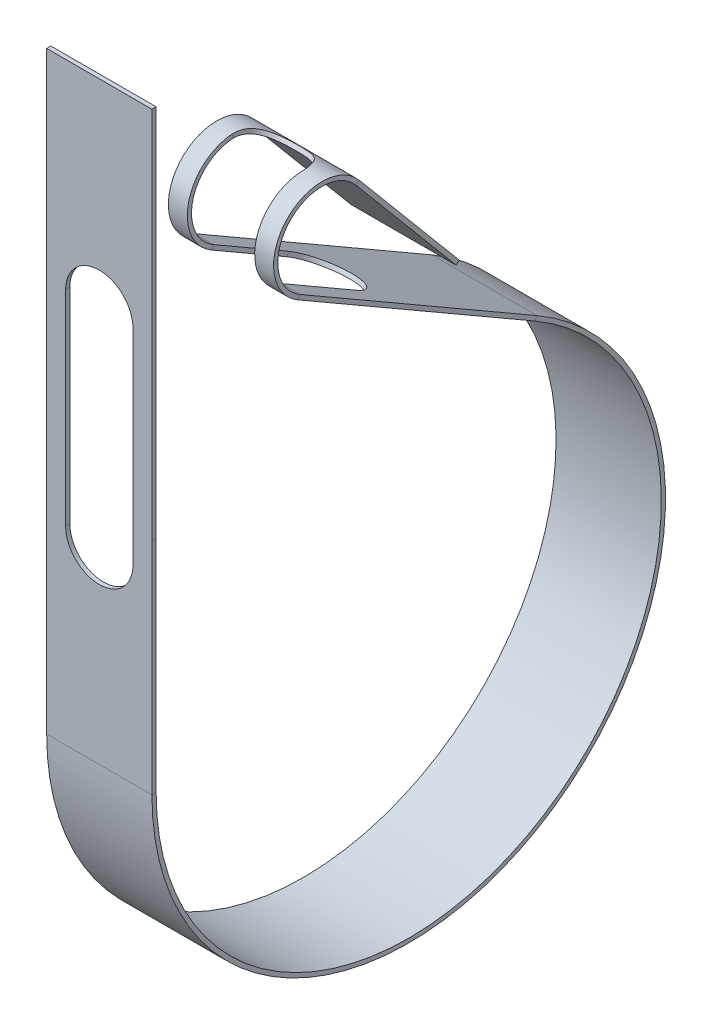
ISO-10303-21;
HEADER;
FILE_DESCRIPTION(('STEP AP214'),'2;1');
FILE_NAME('part.step','',(''),(''),'','','');
FILE_SCHEMA(('AUTOMOTIVE_DESIGN { 1 0 10303 214 1 1 1 1 }'));
ENDSEC;
DATA;
#1=APPLICATION_CONTEXT('core data for automotive mechanical design processes');
#2=APPLICATION_PROTOCOL_DEFINITION('international standard','automotive_design',2000,#1);
#3=PRODUCT_CONTEXT('',#1,'mechanical');
#4=PRODUCT('Part','Part','',(#3));
#5=PRODUCT_RELATED_PRODUCT_CATEGORY('part','',(#4));
#6=PRODUCT_DEFINITION_FORMATION('','',#4);
#7=PRODUCT_DEFINITION_CONTEXT('part definition',#1,'design');
#8=PRODUCT_DEFINITION('design','',#6,#7);
#9=PRODUCT_DEFINITION_SHAPE('','',#8);
#10=(LENGTH_UNIT() NAMED_UNIT(*) SI_UNIT(.MILLI.,.METRE.));
#11=(NAMED_UNIT(*) PLANE_ANGLE_UNIT() SI_UNIT($,.RADIAN.));
#12=(NAMED_UNIT(*) SI_UNIT($,.STERADIAN.) SOLID_ANGLE_UNIT());
#13=UNCERTAINTY_MEASURE_WITH_UNIT(LENGTH_MEASURE(1.E-05),#10,'distance_accuracy_value','');
#14=(GEOMETRIC_REPRESENTATION_CONTEXT(3) GLOBAL_UNCERTAINTY_ASSIGNED_CONTEXT((#13)) GLOBAL_UNIT_ASSIGNED_CONTEXT((#10,
#11,#12)) REPRESENTATION_CONTEXT('',''));
#15=CARTESIAN_POINT('',(0.,0.,0.));
#16=DIRECTION('',(0.,0.,1.));
#17=DIRECTION('',(1.,0.,0.));
#18=AXIS2_PLACEMENT_3D('',#15,#16,#17);
#19=CARTESIAN_POINT('',(25.,517.020311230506,31.1886671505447));
#20=DIRECTION('',(-1.,0.,0.));
#21=DIRECTION('',(0.,0.866025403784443,-0.499999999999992));
#22=AXIS2_PLACEMENT_3D('',#19,#20,#21);
#23=PLANE('',#22);
#24=DIRECTION('',(0.,-0.499999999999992,-0.866025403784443));
#25=VECTOR('',#24,1.);
#26=CARTESIAN_POINT('',(25.,516.154285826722,31.6886671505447));
#27=LINE('',#26,#25);
#28=CARTESIAN_POINT('',(25.,478.427825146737,-33.6554795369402));
#29=VERTEX_POINT('',#28);
#30=CARTESIAN_POINT('',(25.,445.89730109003,-89.9999999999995));
#31=VERTEX_POINT('',#30);
#32=EDGE_CURVE('E75',#29,#31,#27,.T.);
#33=ORIENTED_EDGE('',*,*,#32,.T.);
#34=DIRECTION('',(0.,0.866025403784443,-0.499999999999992));
#35=VECTOR('',#34,1.);
#36=CARTESIAN_POINT('',(25.,446.763326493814,-90.4999999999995));
#37=LINE('',#36,#35);
#38=CARTESIAN_POINT('',(25.,446.763326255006,-90.4999998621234));
#39=VERTEX_POINT('',#38);
#40=EDGE_CURVE('E225',#31,#39,#37,.T.);
#41=ORIENTED_EDGE('',*,*,#40,.T.);
#42=DIRECTION('',(0.,-0.499999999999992,-0.866025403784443));
#43=VECTOR('',#42,1.);
#44=CARTESIAN_POINT('',(25.,517.020311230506,31.1886671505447));
#45=LINE('',#44,#43);
#46=CARTESIAN_POINT('',(25.,479.293850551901,-34.1554795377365));
#47=VERTEX_POINT('',#46);
#48=EDGE_CURVE('E227',#47,#39,#45,.T.);
#49=ORIENTED_EDGE('',*,*,#48,.F.);
#50=DIRECTION('',(0.,-0.866025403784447,0.499999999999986));
#51=VECTOR('',#50,1.);
#52=CARTESIAN_POINT('',(25.,479.293850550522,-34.1554795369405));
#53=LINE('',#52,#51);
#54=EDGE_CURVE('E512',#47,#29,#53,.T.);
#55=ORIENTED_EDGE('',*,*,#54,.T.);
#56=EDGE_LOOP('',(#33,#41,#49,#55));
#57=FACE_BOUND('',#56,.T.);
#58=ADVANCED_FACE('F51',(#57),#23,.F.);
#59=CARTESIAN_POINT('',(25.,516.154285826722,31.6886671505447));
#60=DIRECTION('',(0.,0.866025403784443,-0.499999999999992));
#61=DIRECTION('',(1.,0.,0.));
#62=AXIS2_PLACEMENT_3D('',#59,#60,#61);
#63=PLANE('',#62);
#64=DIRECTION('',(0.,0.499999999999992,0.866025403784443));
#65=VECTOR('',#64,1.);
#66=CARTESIAN_POINT('',(0.,293.026278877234,-354.780377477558));
#67=LINE('',#66,#65);
#68=CARTESIAN_POINT('',(0.,445.89730109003,-89.9999999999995));
#69=VERTEX_POINT('',#68);
#70=CARTESIAN_POINT('',(0.,478.427825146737,-33.6554795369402));
#71=VERTEX_POINT('',#70);
#72=EDGE_CURVE('E68',#69,#71,#67,.T.);
#73=ORIENTED_EDGE('',*,*,#72,.F.);
#74=DIRECTION('',(1.,0.,0.));
#75=VECTOR('',#74,1.);
#76=CARTESIAN_POINT('',(25.,445.89730109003,-89.9999999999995));
#77=LINE('',#76,#75);
#78=EDGE_CURVE('E60',#69,#31,#77,.T.);
#79=ORIENTED_EDGE('',*,*,#78,.T.);
#80=ORIENTED_EDGE('',*,*,#32,.F.);
#81=DIRECTION('',(-1.,0.,0.));
#82=VECTOR('',#81,1.);
#83=CARTESIAN_POINT('',(25.,478.427825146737,-33.6554795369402));
#84=LINE('',#83,#82);
#85=CARTESIAN_POINT('',(20.5000000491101,478.427825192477,-33.6554795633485));
#86=VERTEX_POINT('',#85);
#87=EDGE_CURVE('E509',#29,#86,#84,.T.);
#88=ORIENTED_EDGE('',*,*,#87,.T.);
#89=DIRECTION('',(0.,-0.499999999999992,-0.866025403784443));
#90=VECTOR('',#89,1.);
#91=CARTESIAN_POINT('',(20.5000000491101,492.479381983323,-9.31746917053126));
#92=LINE('',#91,#90);
#93=CARTESIAN_POINT('',(20.5000000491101,468.137137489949,-51.4794734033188));
#94=VERTEX_POINT('',#93);
#95=EDGE_CURVE('E507',#86,#94,#92,.T.);
#96=ORIENTED_EDGE('',*,*,#95,.T.);
#97=CARTESIAN_POINT('',(12.5000000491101,468.137137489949,-51.4794734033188));
#98=DIRECTION('',(0.,0.866025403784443,-0.499999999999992));
#99=DIRECTION('',(1.,0.,0.));
#100=AXIS2_PLACEMENT_3D('',#97,#98,#99);
#101=CIRCLE('',#100,8.00000000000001);
#102=CARTESIAN_POINT('',(4.50000004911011,468.137137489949,-51.4794734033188));
#103=VERTEX_POINT('',#102);
#104=EDGE_CURVE('E504',#94,#103,#101,.T.);
#105=ORIENTED_EDGE('',*,*,#104,.T.);
#106=DIRECTION('',(0.,0.499999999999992,0.866025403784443));
#107=VECTOR('',#106,1.);
#108=CARTESIAN_POINT('',(4.50000004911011,468.137137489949,-51.4794734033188));
#109=LINE('',#108,#107);
#110=CARTESIAN_POINT('',(4.50000004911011,478.427825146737,-33.6554795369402));
#111=VERTEX_POINT('',#110);
#112=EDGE_CURVE('E502',#103,#111,#109,.T.);
#113=ORIENTED_EDGE('',*,*,#112,.T.);
#114=DIRECTION('',(-1.,0.,0.));
#115=VECTOR('',#114,1.);
#116=CARTESIAN_POINT('',(25.,478.427825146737,-33.6554795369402));
#117=LINE('',#116,#115);
#118=EDGE_CURVE('E500',#111,#71,#117,.T.);
#119=ORIENTED_EDGE('',*,*,#118,.T.);
#120=EDGE_LOOP('',(#73,#79,#80,#88,#96,#105,#113,#119));
#121=FACE_BOUND('',#120,.T.);
#122=ADVANCED_FACE('F564',(#121),#63,.F.);
#123=CARTESIAN_POINT('',(0.,293.892304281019,-355.280377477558));
#124=DIRECTION('',(1.,0.,0.));
#125=DIRECTION('',(0.,-0.866025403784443,0.499999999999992));
#126=AXIS2_PLACEMENT_3D('',#123,#124,#125);
#127=PLANE('',#126);
#128=DIRECTION('',(0.,0.499999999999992,0.866025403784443));
#129=VECTOR('',#128,1.);
#130=CARTESIAN_POINT('',(0.,293.892304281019,-355.280377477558));
#131=LINE('',#130,#129);
#132=CARTESIAN_POINT('',(0.,446.763326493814,-90.4999999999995));
#133=VERTEX_POINT('',#132);
#134=CARTESIAN_POINT('',(0.,479.293850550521,-34.1554795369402));
#135=VERTEX_POINT('',#134);
#136=EDGE_CURVE('E55',#133,#135,#131,.T.);
#137=ORIENTED_EDGE('',*,*,#136,.F.);
#138=DIRECTION('',(0.,-0.866025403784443,0.499999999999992));
#139=VECTOR('',#138,1.);
#140=CARTESIAN_POINT('',(0.,446.763326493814,-90.4999999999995));
#141=LINE('',#140,#139);
#142=EDGE_CURVE('E12',#133,#69,#141,.T.);
#143=ORIENTED_EDGE('',*,*,#142,.T.);
#144=ORIENTED_EDGE('',*,*,#72,.T.);
#145=DIRECTION('',(0.,0.866025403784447,-0.499999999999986));
#146=VECTOR('',#145,1.);
#147=CARTESIAN_POINT('',(0.,479.293850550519,-34.1554795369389));
#148=LINE('',#147,#146);
#149=EDGE_CURVE('E484',#71,#135,#148,.T.);
#150=ORIENTED_EDGE('',*,*,#149,.T.);
#151=EDGE_LOOP('',(#137,#143,#144,#150));
#152=FACE_BOUND('',#151,.T.);
#153=ADVANCED_FACE('F53',(#152),#127,.F.);
#154=CARTESIAN_POINT('',(25.,466.750091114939,-71.2678767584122));
#155=DIRECTION('',(0.,-0.642787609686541,0.766044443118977));
#156=DIRECTION('',(1.,0.,0.));
#157=AXIS2_PLACEMENT_3D('',#154,#155,#156);
#158=PLANE('',#157);
#159=DIRECTION('',(0.,0.766044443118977,0.642787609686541));
#160=VECTOR('',#159,1.);
#161=CARTESIAN_POINT('',(25.,466.750091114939,-71.2678767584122));
#162=LINE('',#161,#160);
#163=CARTESIAN_POINT('',(25.,466.750091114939,-71.2678767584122));
#164=VERTEX_POINT('',#163);
#165=CARTESIAN_POINT('',(25.,495.136387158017,-47.4489461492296));
#166=VERTEX_POINT('',#165);
#167=EDGE_CURVE('E530',#164,#166,#162,.T.);
#168=ORIENTED_EDGE('',*,*,#167,.T.);
#169=DIRECTION('',(-1.,0.,0.));
#170=VECTOR('',#169,1.);
#171=CARTESIAN_POINT('',(25.,495.136387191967,-47.4489461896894));
#172=LINE('',#171,#170);
#173=CARTESIAN_POINT('',(0.,495.136387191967,-47.4489461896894));
#174=VERTEX_POINT('',#173);
#175=EDGE_CURVE('E542',#166,#174,#172,.T.);
#176=ORIENTED_EDGE('',*,*,#175,.T.);
#177=DIRECTION('',(0.,-0.766044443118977,-0.642787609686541));
#178=VECTOR('',#177,1.);
#179=CARTESIAN_POINT('',(0.,808.60203077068,215.579959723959));
#180=LINE('',#179,#178);
#181=CARTESIAN_POINT('',(0.,466.750091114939,-71.2678767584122));
#182=VERTEX_POINT('',#181);
#183=EDGE_CURVE('E539',#174,#182,#180,.T.);
#184=ORIENTED_EDGE('',*,*,#183,.T.);
#185=DIRECTION('',(1.,0.,0.));
#186=VECTOR('',#185,1.);
#187=CARTESIAN_POINT('',(0.,466.750091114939,-71.2678767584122));
#188=LINE('',#187,#186);
#189=EDGE_CURVE('E527',#182,#164,#188,.T.);
#190=ORIENTED_EDGE('',*,*,#189,.T.);
#191=EDGE_LOOP('',(#168,#176,#184,#190));
#192=FACE_BOUND('',#191,.T.);
#193=ADVANCED_FACE('F583',(#192),#158,.T.);
#194=CARTESIAN_POINT('',(25.,467.392878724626,-72.0339212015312));
#195=DIRECTION('',(0.,-0.642787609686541,0.766044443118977));
#196=DIRECTION('',(1.,0.,0.));
#197=AXIS2_PLACEMENT_3D('',#194,#195,#196);
#198=PLANE('',#197);
#199=DIRECTION('',(-1.,0.,0.));
#200=VECTOR('',#199,1.);
#201=CARTESIAN_POINT('',(25.,495.779174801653,-48.2149906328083));
#202=LINE('',#201,#200);
#203=CARTESIAN_POINT('',(25.,495.779174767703,-48.2149905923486));
#204=VERTEX_POINT('',#203);
#205=CARTESIAN_POINT('',(0.,495.779174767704,-48.2149905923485));
#206=VERTEX_POINT('',#205);
#207=EDGE_CURVE('E547',#204,#206,#202,.T.);
#208=ORIENTED_EDGE('',*,*,#207,.F.);
#209=DIRECTION('',(0.,0.766044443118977,0.642787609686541));
#210=VECTOR('',#209,1.);
#211=CARTESIAN_POINT('',(25.,467.392878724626,-72.0339212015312));
#212=LINE('',#211,#210);
#213=CARTESIAN_POINT('',(25.,467.392878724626,-72.0339212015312));
#214=VERTEX_POINT('',#213);
#215=EDGE_CURVE('E534',#214,#204,#212,.T.);
#216=ORIENTED_EDGE('',*,*,#215,.F.);
#217=DIRECTION('',(1.,0.,0.));
#218=VECTOR('',#217,1.);
#219=CARTESIAN_POINT('',(0.,467.392878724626,-72.0339212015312));
#220=LINE('',#219,#218);
#221=CARTESIAN_POINT('',(0.,467.392878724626,-72.0339212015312));
#222=VERTEX_POINT('',#221);
#223=EDGE_CURVE('E492',#222,#214,#220,.T.);
#224=ORIENTED_EDGE('',*,*,#223,.F.);
#225=DIRECTION('',(0.,-0.766044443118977,-0.642787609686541));
#226=VECTOR('',#225,1.);
#227=CARTESIAN_POINT('',(0.,809.244818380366,214.81391528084));
#228=LINE('',#227,#226);
#229=EDGE_CURVE('E531',#206,#222,#228,.T.);
#230=ORIENTED_EDGE('',*,*,#229,.F.);
#231=EDGE_LOOP('',(#208,#216,#224,#230));
#232=FACE_BOUND('',#231,.T.);
#233=ADVANCED_FACE('F575',(#232),#198,.F.);
#234=CARTESIAN_POINT('',(0.,466.750091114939,-71.2678767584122));
#235=DIRECTION('',(0.,0.766044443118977,0.642787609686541));
#236=DIRECTION('',(-1.,0.,0.));
#237=AXIS2_PLACEMENT_3D('',#234,#235,#236);
#238=PLANE('',#237);
#239=ORIENTED_EDGE('',*,*,#223,.T.);
#240=DIRECTION('',(0.,0.642787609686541,-0.766044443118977));
#241=VECTOR('',#240,1.);
#242=CARTESIAN_POINT('',(25.,466.750091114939,-71.2678767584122));
#243=LINE('',#242,#241);
#244=EDGE_CURVE('E538',#164,#214,#243,.T.);
#245=ORIENTED_EDGE('',*,*,#244,.F.);
#246=ORIENTED_EDGE('',*,*,#189,.F.);
#247=DIRECTION('',(0.,0.642787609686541,-0.766044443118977));
#248=VECTOR('',#247,1.);
#249=CARTESIAN_POINT('',(0.,466.750091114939,-71.2678767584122));
#250=LINE('',#249,#248);
#251=EDGE_CURVE('E535',#182,#222,#250,.T.);
#252=ORIENTED_EDGE('',*,*,#251,.T.);
#253=EDGE_LOOP('',(#239,#245,#246,#252));
#254=FACE_BOUND('',#253,.T.);
#255=ADVANCED_FACE('F649',(#254),#238,.F.);
#256=CARTESIAN_POINT('',(25.,466.750091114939,-71.2678767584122));
#257=DIRECTION('',(-1.,0.,0.));
#258=DIRECTION('',(0.,-0.642787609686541,0.766044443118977));
#259=AXIS2_PLACEMENT_3D('',#256,#257,#258);
#260=PLANE('',#259);
#261=DIRECTION('',(0.,0.642787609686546,-0.766044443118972));
#262=VECTOR('',#261,1.);
#263=CARTESIAN_POINT('',(25.,495.136387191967,-47.4489461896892));
#264=LINE('',#263,#262);
#265=EDGE_CURVE('E545',#166,#204,#264,.T.);
#266=ORIENTED_EDGE('',*,*,#265,.F.);
#267=ORIENTED_EDGE('',*,*,#167,.F.);
#268=ORIENTED_EDGE('',*,*,#244,.T.);
#269=ORIENTED_EDGE('',*,*,#215,.T.);
#270=EDGE_LOOP('',(#266,#267,#268,#269));
#271=FACE_BOUND('',#270,.T.);
#272=ADVANCED_FACE('F646',(#271),#260,.F.);
#273=CARTESIAN_POINT('',(0.,808.60203077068,215.579959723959));
#274=DIRECTION('',(1.,0.,0.));
#275=DIRECTION('',(0.,0.642787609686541,-0.766044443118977));
#276=AXIS2_PLACEMENT_3D('',#273,#274,#275);
#277=PLANE('',#276);
#278=DIRECTION('',(0.,-0.642787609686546,0.766044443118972));
#279=VECTOR('',#278,1.);
#280=CARTESIAN_POINT('',(0.,495.136387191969,-47.4489461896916));
#281=LINE('',#280,#279);
#282=EDGE_CURVE('E250',#206,#174,#281,.T.);
#283=ORIENTED_EDGE('',*,*,#282,.F.);
#284=ORIENTED_EDGE('',*,*,#229,.T.);
#285=ORIENTED_EDGE('',*,*,#251,.F.);
#286=ORIENTED_EDGE('',*,*,#183,.F.);
#287=EDGE_LOOP('',(#283,#284,#285,#286));
#288=FACE_BOUND('',#287,.T.);
#289=ADVANCED_FACE('F581',(#288),#277,.F.);
#290=CARTESIAN_POINT('',(12.5000000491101,469.003162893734,-51.9794734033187));
#291=DIRECTION('',(0.,-0.866025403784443,0.499999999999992));
#292=DIRECTION('',(-1.,0.,0.));
#293=AXIS2_PLACEMENT_3D('',#290,#291,#292);
#294=CYLINDRICAL_SURFACE('',#293,8.00000000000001);
#295=ORIENTED_EDGE('',*,*,#104,.F.);
#296=DIRECTION('',(0.,-0.866025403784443,0.499999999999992));
#297=VECTOR('',#296,1.);
#298=CARTESIAN_POINT('',(20.5000000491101,469.003162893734,-51.9794734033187));
#299=LINE('',#298,#297);
#300=CARTESIAN_POINT('',(20.5000000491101,469.003162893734,-51.9794734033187));
#301=VERTEX_POINT('',#300);
#302=EDGE_CURVE('E495',#301,#94,#299,.T.);
#303=ORIENTED_EDGE('',*,*,#302,.F.);
#304=CARTESIAN_POINT('',(12.5000000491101,469.003162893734,-51.9794734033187));
#305=DIRECTION('',(0.,0.866025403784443,-0.499999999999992));
#306=DIRECTION('',(1.,0.,0.));
#307=AXIS2_PLACEMENT_3D('',#304,#305,#306);
#308=CIRCLE('',#307,8.00000000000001);
#309=CARTESIAN_POINT('',(4.50000004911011,469.003162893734,-51.9794734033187));
#310=VERTEX_POINT('',#309);
#311=EDGE_CURVE('E515',#301,#310,#308,.T.);
#312=ORIENTED_EDGE('',*,*,#311,.T.);
#313=DIRECTION('',(0.,-0.866025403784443,0.499999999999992));
#314=VECTOR('',#313,1.);
#315=CARTESIAN_POINT('',(4.50000004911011,469.003162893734,-51.9794734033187));
#316=LINE('',#315,#314);
#317=EDGE_CURVE('E241',#310,#103,#316,.T.);
#318=ORIENTED_EDGE('',*,*,#317,.T.);
#319=EDGE_LOOP('',(#295,#303,#312,#318));
#320=FACE_BOUND('',#319,.T.);
#321=ADVANCED_FACE('F645',(#320),#294,.F.);
#322=CARTESIAN_POINT('',(25.,517.020311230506,31.1886671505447));
#323=DIRECTION('',(0.,0.866025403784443,-0.499999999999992));
#324=DIRECTION('',(1.,0.,0.));
#325=AXIS2_PLACEMENT_3D('',#322,#323,#324);
#326=PLANE('',#325);
#327=DIRECTION('',(1.,0.,0.));
#328=VECTOR('',#327,1.);
#329=CARTESIAN_POINT('',(25.,446.763326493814,-90.4999999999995));
#330=LINE('',#329,#328);
#331=EDGE_CURVE('E232',#133,#39,#330,.T.);
#332=ORIENTED_EDGE('',*,*,#331,.F.);
#333=ORIENTED_EDGE('',*,*,#136,.T.);
#334=DIRECTION('',(-1.,0.,0.));
#335=VECTOR('',#334,1.);
#336=CARTESIAN_POINT('',(25.,479.293850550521,-34.1554795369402));
#337=LINE('',#336,#335);
#338=CARTESIAN_POINT('',(4.50000004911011,479.293850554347,-34.1554795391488));
#339=VERTEX_POINT('',#338);
#340=EDGE_CURVE('E524',#339,#135,#337,.T.);
#341=ORIENTED_EDGE('',*,*,#340,.F.);
#342=DIRECTION('',(0.,0.499999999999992,0.866025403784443));
#343=VECTOR('',#342,1.);
#344=CARTESIAN_POINT('',(4.50000004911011,469.003162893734,-51.9794734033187));
#345=LINE('',#344,#343);
#346=EDGE_CURVE('E493',#310,#339,#345,.T.);
#347=ORIENTED_EDGE('',*,*,#346,.F.);
#348=ORIENTED_EDGE('',*,*,#311,.F.);
#349=DIRECTION('',(0.,-0.499999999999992,-0.866025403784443));
#350=VECTOR('',#349,1.);
#351=CARTESIAN_POINT('',(20.5000000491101,493.345407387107,-9.81746917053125));
#352=LINE('',#351,#350);
#353=CARTESIAN_POINT('',(20.5000000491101,479.293850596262,-34.1554795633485));
#354=VERTEX_POINT('',#353);
#355=EDGE_CURVE('E498',#354,#301,#352,.T.);
#356=ORIENTED_EDGE('',*,*,#355,.F.);
#357=DIRECTION('',(-1.,0.,0.));
#358=VECTOR('',#357,1.);
#359=CARTESIAN_POINT('',(25.,479.293850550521,-34.1554795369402));
#360=LINE('',#359,#358);
#361=EDGE_CURVE('E240',#47,#354,#360,.T.);
#362=ORIENTED_EDGE('',*,*,#361,.F.);
#363=ORIENTED_EDGE('',*,*,#48,.T.);
#364=EDGE_LOOP('',(#332,#333,#341,#347,#348,#356,#362,#363));
#365=FACE_BOUND('',#364,.T.);
#366=ADVANCED_FACE('F237',(#365),#326,.T.);
#367=CARTESIAN_POINT('',(20.5000000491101,493.345407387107,-9.81746917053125));
#368=DIRECTION('',(-1.,0.,0.));
#369=DIRECTION('',(0.,0.866025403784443,-0.499999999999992));
#370=AXIS2_PLACEMENT_3D('',#367,#368,#369);
#371=PLANE('',#370);
#372=DIRECTION('',(0.,-0.866025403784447,0.499999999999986));
#373=VECTOR('',#372,1.);
#374=CARTESIAN_POINT('',(20.5000000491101,479.293850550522,-34.1554795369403));
#375=LINE('',#374,#373);
#376=EDGE_CURVE('E518',#354,#86,#375,.T.);
#377=ORIENTED_EDGE('',*,*,#376,.F.);
#378=ORIENTED_EDGE('',*,*,#355,.T.);
#379=ORIENTED_EDGE('',*,*,#302,.T.);
#380=ORIENTED_EDGE('',*,*,#95,.F.);
#381=EDGE_LOOP('',(#377,#378,#379,#380));
#382=FACE_BOUND('',#381,.T.);
#383=ADVANCED_FACE('F644',(#382),#371,.T.);
#384=CARTESIAN_POINT('',(4.50000004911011,469.003162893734,-51.9794734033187));
#385=DIRECTION('',(1.,0.,0.));
#386=DIRECTION('',(0.,-0.866025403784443,0.499999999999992));
#387=AXIS2_PLACEMENT_3D('',#384,#385,#386);
#388=PLANE('',#387);
#389=DIRECTION('',(0.,0.866025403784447,-0.499999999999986));
#390=VECTOR('',#389,1.);
#391=CARTESIAN_POINT('',(4.50000004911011,479.293850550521,-34.1554795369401));
#392=LINE('',#391,#390);
#393=EDGE_CURVE('E521',#111,#339,#392,.T.);
#394=ORIENTED_EDGE('',*,*,#393,.F.);
#395=ORIENTED_EDGE('',*,*,#112,.F.);
#396=ORIENTED_EDGE('',*,*,#317,.F.);
#397=ORIENTED_EDGE('',*,*,#346,.T.);
#398=EDGE_LOOP('',(#394,#395,#396,#397));
#399=FACE_BOUND('',#398,.T.);
#400=ADVANCED_FACE('F660',(#399),#388,.T.);
#401=CARTESIAN_POINT('',(25.,488.387117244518,-39.4054795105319));
#402=DIRECTION('',(-1.,0.,0.));
#403=DIRECTION('',(0.,0.866025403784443,-0.499999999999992));
#404=AXIS2_PLACEMENT_3D('',#401,#402,#403);
#405=PLANE('',#404);
#406=ORIENTED_EDGE('',*,*,#265,.T.);
#407=CARTESIAN_POINT('',(25.,488.387117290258,-39.4054795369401));
#408=DIRECTION('',(1.,0.,0.));
#409=DIRECTION('',(0.,-0.866025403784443,0.499999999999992));
#410=AXIS2_PLACEMENT_3D('',#407,#408,#409);
#411=CIRCLE('',#410,11.4999999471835);
#412=EDGE_CURVE('E270',#204,#29,#411,.T.);
#413=ORIENTED_EDGE('',*,*,#412,.T.);
#414=ORIENTED_EDGE('',*,*,#54,.F.);
#415=CARTESIAN_POINT('',(25.,488.387117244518,-39.4054795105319));
#416=DIRECTION('',(1.,0.,0.));
#417=DIRECTION('',(0.,-0.866025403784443,0.499999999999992));
#418=AXIS2_PLACEMENT_3D('',#415,#416,#417);
#419=CIRCLE('',#418,10.4999999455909);
#420=EDGE_CURVE('E347',#166,#47,#419,.T.);
#421=ORIENTED_EDGE('',*,*,#420,.F.);
#422=EDGE_LOOP('',(#406,#413,#414,#421));
#423=FACE_BOUND('',#422,.T.);
#424=ADVANCED_FACE('F587',(#423),#405,.F.);
#425=CARTESIAN_POINT('',(20.5000000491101,488.387117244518,-39.4054795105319));
#426=DIRECTION('',(1.,0.,0.));
#427=DIRECTION('',(0.,-0.866025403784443,0.499999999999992));
#428=AXIS2_PLACEMENT_3D('',#425,#426,#427);
#429=PLANE('',#428);
#430=ORIENTED_EDGE('',*,*,#376,.T.);
#431=CARTESIAN_POINT('',(20.5000000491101,488.387117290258,-39.4054795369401));
#432=DIRECTION('',(1.,0.,0.));
#433=DIRECTION('',(0.,-0.866025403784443,0.499999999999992));
#434=AXIS2_PLACEMENT_3D('',#431,#432,#433);
#435=CIRCLE('',#434,11.4999999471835);
#436=CARTESIAN_POINT('',(20.5000000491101,499.864183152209,-38.6795608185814));
#437=VERTEX_POINT('',#436);
#438=EDGE_CURVE('E357',#86,#437,#435,.F.);
#439=ORIENTED_EDGE('',*,*,#438,.T.);
#440=CARTESIAN_POINT('',(20.5000000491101,498.866177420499,-38.7426841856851));
#441=CARTESIAN_POINT('',(20.5000000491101,499.864183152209,-38.6795608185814));
#442=B_SPLINE_CURVE_WITH_KNOTS('',1,(#440,#441),.UNSPECIFIED.,.F.,.F.,(2,2),(0.,1.),.UNSPECIFIED.);
#443=CARTESIAN_POINT('',(20.5000000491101,498.866177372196,-38.7426841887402));
#444=VERTEX_POINT('',#443);
#445=EDGE_CURVE('E471',#437,#444,#442,.F.);
#446=ORIENTED_EDGE('',*,*,#445,.T.);
#447=CARTESIAN_POINT('',(20.5000000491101,488.387117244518,-39.4054795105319));
#448=DIRECTION('',(-1.,0.,0.));
#449=DIRECTION('',(0.,-0.866025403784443,0.499999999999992));
#450=AXIS2_PLACEMENT_3D('',#447,#448,#449);
#451=CIRCLE('',#450,10.4999999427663);
#452=EDGE_CURVE('E350',#354,#444,#451,.T.);
#453=ORIENTED_EDGE('',*,*,#452,.F.);
#454=EDGE_LOOP('',(#430,#439,#446,#453));
#455=FACE_BOUND('',#454,.T.);
#456=ADVANCED_FACE('F432',(#455),#429,.F.);
#457=CARTESIAN_POINT('',(20.5000000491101,499.864183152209,-38.6795608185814));
#458=CARTESIAN_POINT('',(20.4964979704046,499.938637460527,-39.8567132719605));
#459=CARTESIAN_POINT('',(20.2938141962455,499.826672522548,-40.9486326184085));
#460=CARTESIAN_POINT('',(19.6909978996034,499.499315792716,-42.4084330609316));
#461=CARTESIAN_POINT('',(19.4402616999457,499.363563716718,-42.8657216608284));
#462=CARTESIAN_POINT('',(18.9894612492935,499.133641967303,-43.5059209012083));
#463=CARTESIAN_POINT('',(18.8267450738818,499.052605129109,-43.7117290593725));
#464=CARTESIAN_POINT('',(18.5639967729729,498.926021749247,-44.0090755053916));
#465=CARTESIAN_POINT('',(18.4733016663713,498.882988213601,-44.1062981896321));
#466=CARTESIAN_POINT('',(18.3325904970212,498.817365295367,-44.2493082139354));
#467=CARTESIAN_POINT('',(18.2849086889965,498.795312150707,-44.296507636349));
#468=CARTESIAN_POINT('',(18.2122188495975,498.761986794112,-44.3666034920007));
#469=CARTESIAN_POINT('',(18.1877943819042,498.75083739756,-44.3898515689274));
#470=CARTESIAN_POINT('',(18.1385564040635,498.728460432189,-44.4361137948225));
#471=CARTESIAN_POINT('',(18.1130290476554,498.716911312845,-44.4597815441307));
#472=CARTESIAN_POINT('',(17.7000279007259,498.530875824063,-44.8379269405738));
#473=CARTESIAN_POINT('',(17.2920682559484,498.359634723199,-45.1402313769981));
#474=CARTESIAN_POINT('',(16.4376436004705,498.049823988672,-45.6481217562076));
#475=CARTESIAN_POINT('',(15.99117858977,497.911216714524,-45.8538006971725));
#476=CARTESIAN_POINT('',(15.0597432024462,497.683255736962,-46.178302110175));
#477=CARTESIAN_POINT('',(14.5747728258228,497.593868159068,-46.2971817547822));
#478=CARTESIAN_POINT('',(13.5663267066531,497.473723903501,-46.4548342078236));
#479=CARTESIAN_POINT('',(13.0431959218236,497.442947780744,-46.4936339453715));
#480=CARTESIAN_POINT('',(11.9570491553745,497.443034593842,-46.4935230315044));
#481=CARTESIAN_POINT('',(11.4333061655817,497.473874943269,-46.4546404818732));
#482=CARTESIAN_POINT('',(10.4244809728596,497.594098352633,-46.2968752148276));
#483=CARTESIAN_POINT('',(9.93939876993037,497.683500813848,-46.1779656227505));
#484=CARTESIAN_POINT('',(9.00789515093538,497.911446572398,-45.8534610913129));
#485=CARTESIAN_POINT('',(8.56147373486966,498.050023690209,-45.6478090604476));
#486=CARTESIAN_POINT('',(7.92083720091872,498.282313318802,-45.2669814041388));
#487=CARTESIAN_POINT('',(7.71212428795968,498.363754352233,-45.1279618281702));
#488=CARTESIAN_POINT('',(7.40630381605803,498.489800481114,-44.9003238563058));
#489=CARTESIAN_POINT('',(7.30557180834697,498.53245911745,-44.8212596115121));
#490=CARTESIAN_POINT('',(7.1562860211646,498.597106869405,-44.6977635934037));
#491=CARTESIAN_POINT('',(7.10682612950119,498.618765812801,-44.6557816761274));
#492=CARTESIAN_POINT('',(7.03308934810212,498.651378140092,-44.5915690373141));
#493=CARTESIAN_POINT('',(7.00858593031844,498.662269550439,-44.5699582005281));
#494=CARTESIAN_POINT('',(6.95973011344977,498.684086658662,-44.5263208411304));
#495=CARTESIAN_POINT('',(6.93466856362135,498.695331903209,-44.5036447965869));
#496=CARTESIAN_POINT('',(6.53401700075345,498.875867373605,-44.1366820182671));
#497=CARTESIAN_POINT('',(6.19713718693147,499.043849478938,-43.7517409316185));
#498=CARTESIAN_POINT('',(5.75212348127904,499.27585563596,-43.1118063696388));
#499=CARTESIAN_POINT('',(5.61383658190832,499.349824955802,-42.8880982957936));
#500=CARTESIAN_POINT('',(5.45354171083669,499.436021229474,-42.5953768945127));
#501=CARTESIAN_POINT('',(5.42211092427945,499.452946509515,-42.536179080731));
#502=CARTESIAN_POINT('',(5.37590702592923,499.477822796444,-42.4464028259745));
#503=CARTESIAN_POINT('',(5.36066277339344,499.486029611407,-42.4163141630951));
#504=CARTESIAN_POINT('',(5.33803196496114,499.498206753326,-42.3709364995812));
#505=CARTESIAN_POINT('',(5.32982781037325,499.502617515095,-42.3543482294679));
#506=CARTESIAN_POINT('',(5.31734813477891,499.509334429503,-42.3289120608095));
#507=CARTESIAN_POINT('',(5.31114225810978,499.512684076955,-42.3161389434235));
#508=CARTESIAN_POINT('',(5.25559501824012,499.542746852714,-42.2006850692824));
#509=CARTESIAN_POINT('',(5.20839320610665,499.568873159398,-42.0945326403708));
#510=CARTESIAN_POINT('',(4.98325170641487,499.695116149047,-41.546020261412));
#511=CARTESIAN_POINT('',(4.8379147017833,499.782423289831,-41.0500565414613));
#512=CARTESIAN_POINT('',(4.61679308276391,499.887800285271,-39.9457785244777));
#513=CARTESIAN_POINT('',(4.54102322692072,499.905797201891,-39.3374956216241));
#514=CARTESIAN_POINT('',(4.50000004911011,499.864183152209,-38.6795608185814));
#515=CARTESIAN_POINT('',(20.5000000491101,498.866177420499,-38.7426841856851));
#516=CARTESIAN_POINT('',(20.4964979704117,498.93415744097,-39.8174755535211));
#517=CARTESIAN_POINT('',(20.2938141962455,498.831928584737,-40.8144453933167));
#518=CARTESIAN_POINT('',(19.6909978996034,498.53303765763,-42.1473066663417));
#519=CARTESIAN_POINT('',(19.4402616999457,498.409090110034,-42.564831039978));
#520=CARTESIAN_POINT('',(18.9894612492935,498.199161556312,-43.1493607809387));
#521=CARTESIAN_POINT('',(18.8267450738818,498.125171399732,-43.3372725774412));
#522=CARTESIAN_POINT('',(18.5639967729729,498.009595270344,-43.6087628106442));
#523=CARTESIAN_POINT('',(18.4733016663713,497.970303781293,-43.6975313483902));
#524=CARTESIAN_POINT('',(18.3325904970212,497.910387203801,-43.8281057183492));
#525=CARTESIAN_POINT('',(18.2849086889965,497.890251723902,-43.8712008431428));
#526=CARTESIAN_POINT('',(18.2122188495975,497.859824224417,-43.9352014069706));
#527=CARTESIAN_POINT('',(18.1877943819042,497.849644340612,-43.9564279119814));
#528=CARTESIAN_POINT('',(18.1385564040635,497.829213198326,-43.9986673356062));
#529=CARTESIAN_POINT('',(18.1130290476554,497.818668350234,-44.0202770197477));
#530=CARTESIAN_POINT('',(17.7000279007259,497.648809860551,-44.3655402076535));
#531=CARTESIAN_POINT('',(17.2920682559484,497.492459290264,-44.6415573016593));
#532=CARTESIAN_POINT('',(16.4376436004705,497.209588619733,-45.1052832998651));
#533=CARTESIAN_POINT('',(15.99117858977,497.083034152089,-45.2930771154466));
#534=CARTESIAN_POINT('',(15.0597432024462,496.874895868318,-45.5893610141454));
#535=CARTESIAN_POINT('',(14.5747728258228,496.793281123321,-45.6979032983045));
#536=CARTESIAN_POINT('',(13.5663267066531,496.683584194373,-45.8418468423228));
#537=CARTESIAN_POINT('',(13.0431959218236,496.655484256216,-45.8772726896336));
#538=CARTESIAN_POINT('',(11.9570491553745,496.655563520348,-45.8771714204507));
#539=CARTESIAN_POINT('',(11.4333061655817,496.683722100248,-45.8416699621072));
#540=CARTESIAN_POINT('',(10.4244809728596,496.793491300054,-45.6976234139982));
#541=CARTESIAN_POINT('',(9.93939876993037,496.875119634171,-45.589053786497));
#542=CARTESIAN_POINT('',(9.00789515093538,497.083244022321,-45.2927670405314));
#543=CARTESIAN_POINT('',(8.56147373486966,497.20977095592,-45.1049977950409));
#544=CARTESIAN_POINT('',(7.92083720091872,497.421861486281,-44.7572855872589));
#545=CARTESIAN_POINT('',(7.71212428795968,497.496220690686,-44.6303546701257));
#546=CARTESIAN_POINT('',(7.40630381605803,497.61130628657,-44.4225113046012));
#547=CARTESIAN_POINT('',(7.30557180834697,497.650255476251,-44.3503222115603));
#548=CARTESIAN_POINT('',(7.1562860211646,497.709281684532,-44.2375649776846));
#549=CARTESIAN_POINT('',(7.10682612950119,497.729057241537,-44.1992336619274));
#550=CARTESIAN_POINT('',(7.03308934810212,497.758833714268,-44.1406047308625));
#551=CARTESIAN_POINT('',(7.00858593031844,497.76877804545,-44.120873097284));
#552=CARTESIAN_POINT('',(6.95973011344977,497.788698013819,-44.0810302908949));
#553=CARTESIAN_POINT('',(6.93466856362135,497.79896541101,-44.0603260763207));
#554=CARTESIAN_POINT('',(6.53401700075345,497.963802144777,-43.7252731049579));
#555=CARTESIAN_POINT('',(6.19713718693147,498.117177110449,-43.3738051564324));
#556=CARTESIAN_POINT('',(5.75212348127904,498.329008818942,-42.7895170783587));
#557=CARTESIAN_POINT('',(5.61383658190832,498.396546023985,-42.5852618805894));
#558=CARTESIAN_POINT('',(5.45354171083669,498.475246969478,-42.3179945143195));
#559=CARTESIAN_POINT('',(5.42211092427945,498.49070048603,-42.2639443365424));
#560=CARTESIAN_POINT('',(5.37590702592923,498.513413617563,-42.1819747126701));
#561=CARTESIAN_POINT('',(5.36066277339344,498.52090679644,-42.1545024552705));
#562=CARTESIAN_POINT('',(5.33803196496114,498.532025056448,-42.1130706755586));
#563=CARTESIAN_POINT('',(5.32982781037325,498.536052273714,-42.0979248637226));
#564=CARTESIAN_POINT('',(5.31734813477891,498.542185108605,-42.0747005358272));
#565=CARTESIAN_POINT('',(5.31114225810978,498.545243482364,-42.063038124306));
#566=CARTESIAN_POINT('',(5.25559501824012,498.572692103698,-41.9576237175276));
#567=CARTESIAN_POINT('',(5.20839320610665,498.596546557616,-41.8607019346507));
#568=CARTESIAN_POINT('',(4.98325170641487,498.711811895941,-41.3598862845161));
#569=CARTESIAN_POINT('',(4.8379147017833,498.791527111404,-40.9070498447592));
#570=CARTESIAN_POINT('',(4.61679308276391,498.887740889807,-39.8987960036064));
#571=CARTESIAN_POINT('',(4.54102321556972,498.904172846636,-39.3434071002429));
#572=CARTESIAN_POINT('',(4.50000004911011,498.866177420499,-38.7426841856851));
#573=B_SPLINE_SURFACE_WITH_KNOTS('',1,3,((#457,#458,#459,#460,#461,#462,#463,#464,#465,#466,
#467,#468,#469,#470,#471,#472,#473,#474,#475,#476,#477,#478,#479,#480,#481,#482,#483,#484,#485,
#486,#487,#488,#489,#490,#491,#492,#493,#494,#495,#496,#497,#498,#499,#500,#501,#502,#503,#504,
#505,#506,#507,#508,#509,#510,#511,#512,#513,#514),(#515,#516,#517,#518,#519,#520,#521,#522,
#523,#524,#525,#526,#527,#528,#529,#530,#531,#532,#533,#534,#535,#536,#537,#538,#539,#540,#541,
#542,#543,#544,#545,#546,#547,#548,#549,#550,#551,#552,#553,#554,#555,#556,#557,#558,#559,#560,
#561,#562,#563,#564,#565,#566,#567,#568,#569,#570,#571,#572)),.UNSPECIFIED.,.F.,.F.,.F.,(2,2),
(4,2,2,2,2,2,2,2,2,2,2,2,2,2,2,2,2,2,2,2,2,2,2,2,2,2,2,2,4),(0.,1.),(0.,0.125,0.1875,0.21875,
0.234375,0.2421875,0.24609375,0.25,0.3125,0.375,0.4375,0.5,0.5625,0.625,0.6875,0.71875,0.734375,
0.7421875,0.74609375,0.75,0.8125,0.84375,0.8515625,0.85546875,0.857421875,0.859375,0.875,0.9375,
1.),.UNSPECIFIED.);
#574=CARTESIAN_POINT('',(20.5000000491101,499.864183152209,-38.6795608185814));
#575=CARTESIAN_POINT('',(20.4964979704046,499.938637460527,-39.8567132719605));
#576=CARTESIAN_POINT('',(20.2938141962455,499.826672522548,-40.9486326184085));
#577=CARTESIAN_POINT('',(19.6909978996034,499.499315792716,-42.4084330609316));
#578=CARTESIAN_POINT('',(19.4402616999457,499.363563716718,-42.8657216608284));
#579=CARTESIAN_POINT('',(18.9894612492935,499.133641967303,-43.5059209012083));
#580=CARTESIAN_POINT('',(18.8267450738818,499.052605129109,-43.7117290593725));
#581=CARTESIAN_POINT('',(18.5639967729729,498.926021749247,-44.0090755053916));
#582=CARTESIAN_POINT('',(18.4733016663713,498.882988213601,-44.1062981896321));
#583=CARTESIAN_POINT('',(18.3325904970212,498.817365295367,-44.2493082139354));
#584=CARTESIAN_POINT('',(18.2849086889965,498.795312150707,-44.296507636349));
#585=CARTESIAN_POINT('',(18.2122188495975,498.761986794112,-44.3666034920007));
#586=CARTESIAN_POINT('',(18.1877943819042,498.75083739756,-44.3898515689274));
#587=CARTESIAN_POINT('',(18.1385564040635,498.728460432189,-44.4361137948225));
#588=CARTESIAN_POINT('',(18.1130290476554,498.716911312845,-44.4597815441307));
#589=CARTESIAN_POINT('',(17.7000279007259,498.530875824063,-44.8379269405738));
#590=CARTESIAN_POINT('',(17.2920682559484,498.359634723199,-45.1402313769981));
#591=CARTESIAN_POINT('',(16.4376436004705,498.049823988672,-45.6481217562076));
#592=CARTESIAN_POINT('',(15.99117858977,497.911216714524,-45.8538006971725));
#593=CARTESIAN_POINT('',(15.0597432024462,497.683255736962,-46.178302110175));
#594=CARTESIAN_POINT('',(14.5747728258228,497.593868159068,-46.2971817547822));
#595=CARTESIAN_POINT('',(13.5663267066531,497.473723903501,-46.4548342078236));
#596=CARTESIAN_POINT('',(13.0431959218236,497.442947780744,-46.4936339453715));
#597=CARTESIAN_POINT('',(11.9570491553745,497.443034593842,-46.4935230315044));
#598=CARTESIAN_POINT('',(11.4333061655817,497.473874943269,-46.4546404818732));
#599=CARTESIAN_POINT('',(10.4244809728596,497.594098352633,-46.2968752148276));
#600=CARTESIAN_POINT('',(9.93939876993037,497.683500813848,-46.1779656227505));
#601=CARTESIAN_POINT('',(9.00789515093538,497.911446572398,-45.8534610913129));
#602=CARTESIAN_POINT('',(8.56147373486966,498.050023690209,-45.6478090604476));
#603=CARTESIAN_POINT('',(7.92083720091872,498.282313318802,-45.2669814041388));
#604=CARTESIAN_POINT('',(7.71212428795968,498.363754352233,-45.1279618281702));
#605=CARTESIAN_POINT('',(7.40630381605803,498.489800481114,-44.9003238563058));
#606=CARTESIAN_POINT('',(7.30557180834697,498.53245911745,-44.8212596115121));
#607=CARTESIAN_POINT('',(7.1562860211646,498.597106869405,-44.6977635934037));
#608=CARTESIAN_POINT('',(7.10682612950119,498.618765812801,-44.6557816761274));
#609=CARTESIAN_POINT('',(7.03308934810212,498.651378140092,-44.5915690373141));
#610=CARTESIAN_POINT('',(7.00858593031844,498.662269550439,-44.5699582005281));
#611=CARTESIAN_POINT('',(6.95973011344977,498.684086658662,-44.5263208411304));
#612=CARTESIAN_POINT('',(6.93466856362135,498.695331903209,-44.5036447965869));
#613=CARTESIAN_POINT('',(6.53401700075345,498.875867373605,-44.1366820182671));
#614=CARTESIAN_POINT('',(6.19713718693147,499.043849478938,-43.7517409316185));
#615=CARTESIAN_POINT('',(5.75212348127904,499.27585563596,-43.1118063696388));
#616=CARTESIAN_POINT('',(5.61383658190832,499.349824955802,-42.8880982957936));
#617=CARTESIAN_POINT('',(5.45354171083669,499.436021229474,-42.5953768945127));
#618=CARTESIAN_POINT('',(5.42211092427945,499.452946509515,-42.536179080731));
#619=CARTESIAN_POINT('',(5.37590702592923,499.477822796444,-42.4464028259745));
#620=CARTESIAN_POINT('',(5.36066277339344,499.486029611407,-42.4163141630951));
#621=CARTESIAN_POINT('',(5.33803196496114,499.498206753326,-42.3709364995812));
#622=CARTESIAN_POINT('',(5.32982781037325,499.502617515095,-42.3543482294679));
#623=CARTESIAN_POINT('',(5.31734813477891,499.509334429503,-42.3289120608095));
#624=CARTESIAN_POINT('',(5.31114225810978,499.512684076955,-42.3161389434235));
#625=CARTESIAN_POINT('',(5.25559501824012,499.542746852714,-42.2006850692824));
#626=CARTESIAN_POINT('',(5.20839320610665,499.568873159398,-42.0945326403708));
#627=CARTESIAN_POINT('',(4.98325170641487,499.695116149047,-41.546020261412));
#628=CARTESIAN_POINT('',(4.8379147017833,499.782423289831,-41.0500565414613));
#629=CARTESIAN_POINT('',(4.61679308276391,499.887800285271,-39.9457785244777));
#630=CARTESIAN_POINT('',(4.54102322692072,499.905797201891,-39.3374956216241));
#631=CARTESIAN_POINT('',(4.50000004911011,499.864183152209,-38.6795608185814));
#632=B_SPLINE_CURVE_WITH_KNOTS('',3,(#574,#575,#576,#577,#578,#579,#580,#581,#582,#583,#584,
#585,#586,#587,#588,#589,#590,#591,#592,#593,#594,#595,#596,#597,#598,#599,#600,#601,#602,#603,
#604,#605,#606,#607,#608,#609,#610,#611,#612,#613,#614,#615,#616,#617,#618,#619,#620,#621,#622,
#623,#624,#625,#626,#627,#628,#629,#630,#631),.UNSPECIFIED.,.F.,.F.,(4,2,2,2,2,2,2,2,2,2,2,2,2,
2,2,2,2,2,2,2,2,2,2,2,2,2,2,2,4),(0.,0.125,0.1875,0.21875,0.234375,0.2421875,0.24609375,0.25,
0.3125,0.375,0.4375,0.5,0.5625,0.625,0.6875,0.71875,0.734375,0.7421875,0.74609375,0.75,0.8125,
0.84375,0.8515625,0.85546875,0.857421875,0.859375,0.875,0.9375,1.),.UNSPECIFIED.);
#633=CARTESIAN_POINT('',(4.50000004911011,499.864183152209,-38.6795608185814));
#634=VERTEX_POINT('',#633);
#635=EDGE_CURVE('E363',#437,#634,#632,.T.);
#636=CARTESIAN_POINT('',(4.50000004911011,499.864183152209,-38.6795608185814));
#637=CARTESIAN_POINT('',(4.50000004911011,498.866177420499,-38.7426841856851));
#638=B_SPLINE_CURVE_WITH_KNOTS('',1,(#636,#637),.UNSPECIFIED.,.F.,.F.,(2,2),(0.,1.),.UNSPECIFIED.);
#639=CARTESIAN_POINT('',(4.50000004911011,498.866177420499,-38.7426841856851));
#640=VERTEX_POINT('',#639);
#641=EDGE_CURVE('E354',#634,#640,#638,.T.);
#642=CARTESIAN_POINT('',(4.50000004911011,498.866177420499,-38.7426841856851));
#643=CARTESIAN_POINT('',(4.54102321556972,498.904172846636,-39.3434071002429));
#644=CARTESIAN_POINT('',(4.61679308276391,498.887740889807,-39.8987960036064));
#645=CARTESIAN_POINT('',(4.8379147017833,498.791527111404,-40.9070498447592));
#646=CARTESIAN_POINT('',(4.98325170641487,498.711811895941,-41.3598862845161));
#647=CARTESIAN_POINT('',(5.20839320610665,498.596546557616,-41.8607019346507));
#648=CARTESIAN_POINT('',(5.25559501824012,498.572692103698,-41.9576237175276));
#649=CARTESIAN_POINT('',(5.31114225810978,498.545243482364,-42.063038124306));
#650=CARTESIAN_POINT('',(5.31734813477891,498.542185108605,-42.0747005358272));
#651=CARTESIAN_POINT('',(5.32982781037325,498.536052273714,-42.0979248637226));
#652=CARTESIAN_POINT('',(5.33803196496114,498.532025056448,-42.1130706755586));
#653=CARTESIAN_POINT('',(5.36066277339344,498.52090679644,-42.1545024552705));
#654=CARTESIAN_POINT('',(5.37590702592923,498.513413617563,-42.1819747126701));
#655=CARTESIAN_POINT('',(5.42211092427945,498.49070048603,-42.2639443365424));
#656=CARTESIAN_POINT('',(5.45354171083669,498.475246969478,-42.3179945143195));
#657=CARTESIAN_POINT('',(5.61383658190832,498.396546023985,-42.5852618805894));
#658=CARTESIAN_POINT('',(5.75212348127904,498.329008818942,-42.7895170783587));
#659=CARTESIAN_POINT('',(6.19713718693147,498.117177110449,-43.3738051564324));
#660=CARTESIAN_POINT('',(6.53401700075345,497.963802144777,-43.7252731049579));
#661=CARTESIAN_POINT('',(6.93466856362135,497.79896541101,-44.0603260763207));
#662=CARTESIAN_POINT('',(6.95973011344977,497.788698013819,-44.0810302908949));
#663=CARTESIAN_POINT('',(7.00858593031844,497.76877804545,-44.120873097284));
#664=CARTESIAN_POINT('',(7.03308934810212,497.758833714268,-44.1406047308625));
#665=CARTESIAN_POINT('',(7.10682612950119,497.729057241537,-44.1992336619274));
#666=CARTESIAN_POINT('',(7.1562860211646,497.709281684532,-44.2375649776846));
#667=CARTESIAN_POINT('',(7.30557180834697,497.650255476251,-44.3503222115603));
#668=CARTESIAN_POINT('',(7.40630381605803,497.61130628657,-44.4225113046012));
#669=CARTESIAN_POINT('',(7.71212428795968,497.496220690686,-44.6303546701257));
#670=CARTESIAN_POINT('',(7.92083720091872,497.421861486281,-44.7572855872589));
#671=CARTESIAN_POINT('',(8.56147373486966,497.20977095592,-45.1049977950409));
#672=CARTESIAN_POINT('',(9.00789515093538,497.083244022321,-45.2927670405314));
#673=CARTESIAN_POINT('',(9.93939876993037,496.875119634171,-45.589053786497));
#674=CARTESIAN_POINT('',(10.4244809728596,496.793491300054,-45.6976234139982));
#675=CARTESIAN_POINT('',(11.4333061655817,496.683722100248,-45.8416699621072));
#676=CARTESIAN_POINT('',(11.9570491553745,496.655563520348,-45.8771714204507));
#677=CARTESIAN_POINT('',(13.0431959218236,496.655484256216,-45.8772726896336));
#678=CARTESIAN_POINT('',(13.5663267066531,496.683584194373,-45.8418468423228));
#679=CARTESIAN_POINT('',(14.5747728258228,496.793281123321,-45.6979032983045));
#680=CARTESIAN_POINT('',(15.0597432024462,496.874895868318,-45.5893610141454));
#681=CARTESIAN_POINT('',(15.99117858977,497.083034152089,-45.2930771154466));
#682=CARTESIAN_POINT('',(16.4376436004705,497.209588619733,-45.1052832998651));
#683=CARTESIAN_POINT('',(17.2920682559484,497.492459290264,-44.6415573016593));
#684=CARTESIAN_POINT('',(17.7000279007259,497.648809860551,-44.3655402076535));
#685=CARTESIAN_POINT('',(18.1130290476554,497.818668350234,-44.0202770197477));
#686=CARTESIAN_POINT('',(18.1385564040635,497.829213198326,-43.9986673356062));
#687=CARTESIAN_POINT('',(18.1877943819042,497.849644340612,-43.9564279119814));
#688=CARTESIAN_POINT('',(18.2122188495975,497.859824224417,-43.9352014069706));
#689=CARTESIAN_POINT('',(18.2849086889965,497.890251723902,-43.8712008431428));
#690=CARTESIAN_POINT('',(18.3325904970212,497.910387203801,-43.8281057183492));
#691=CARTESIAN_POINT('',(18.4733016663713,497.970303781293,-43.6975313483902));
#692=CARTESIAN_POINT('',(18.5639967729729,498.009595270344,-43.6087628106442));
#693=CARTESIAN_POINT('',(18.8267450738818,498.125171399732,-43.3372725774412));
#694=CARTESIAN_POINT('',(18.9894612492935,498.199161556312,-43.1493607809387));
#695=CARTESIAN_POINT('',(19.4402616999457,498.409090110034,-42.564831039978));
#696=CARTESIAN_POINT('',(19.6909978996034,498.53303765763,-42.1473066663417));
#697=CARTESIAN_POINT('',(20.2938141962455,498.831928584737,-40.8144453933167));
#698=CARTESIAN_POINT('',(20.4964979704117,498.93415744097,-39.8174755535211));
#699=CARTESIAN_POINT('',(20.5000000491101,498.866177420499,-38.7426841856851));
#700=B_SPLINE_CURVE_WITH_KNOTS('',3,(#642,#643,#644,#645,#646,#647,#648,#649,#650,#651,#652,
#653,#654,#655,#656,#657,#658,#659,#660,#661,#662,#663,#664,#665,#666,#667,#668,#669,#670,#671,
#672,#673,#674,#675,#676,#677,#678,#679,#680,#681,#682,#683,#684,#685,#686,#687,#688,#689,#690,
#691,#692,#693,#694,#695,#696,#697,#698,#699),.UNSPECIFIED.,.F.,.F.,(4,2,2,2,2,2,2,2,2,2,2,2,2,
2,2,2,2,2,2,2,2,2,2,2,2,2,2,2,4),(0.,0.0625,0.125,0.140625,0.142578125,0.14453125,0.1484375,
0.15625,0.1875,0.25,0.25390625,0.2578125,0.265625,0.28125,0.3125,0.375,0.4375,0.5,0.5625,0.625,
0.6875,0.75,0.75390625,0.7578125,0.765625,0.78125,0.8125,0.875,1.),.UNSPECIFIED.);
#701=EDGE_CURVE('E415',#444,#640,#700,.F.);
#702=ORIENTED_EDGE('',*,*,#445,.F.);
#703=ORIENTED_EDGE('',*,*,#635,.T.);
#704=ORIENTED_EDGE('',*,*,#641,.T.);
#705=ORIENTED_EDGE('',*,*,#701,.F.);
#706=EDGE_LOOP('',(#702,#703,#704,#705));
#707=FACE_BOUND('',#706,.T.);
#708=ADVANCED_FACE('F421',(#707),#573,.F.);
#709=CARTESIAN_POINT('',(4.50000004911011,488.387117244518,-39.4054795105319));
#710=DIRECTION('',(-1.,0.,0.));
#711=DIRECTION('',(0.,0.866025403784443,-0.499999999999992));
#712=AXIS2_PLACEMENT_3D('',#709,#710,#711);
#713=PLANE('',#712);
#714=ORIENTED_EDGE('',*,*,#641,.F.);
#715=CARTESIAN_POINT('',(4.50000004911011,488.387117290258,-39.4054795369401));
#716=DIRECTION('',(1.,0.,0.));
#717=DIRECTION('',(0.,-0.866025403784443,0.499999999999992));
#718=AXIS2_PLACEMENT_3D('',#715,#716,#717);
#719=CIRCLE('',#718,11.4999999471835);
#720=EDGE_CURVE('E360',#634,#111,#719,.T.);
#721=ORIENTED_EDGE('',*,*,#720,.T.);
#722=ORIENTED_EDGE('',*,*,#393,.T.);
#723=CARTESIAN_POINT('',(4.50000004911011,488.387117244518,-39.4054795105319));
#724=DIRECTION('',(1.,0.,0.));
#725=DIRECTION('',(0.,0.866025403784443,-0.499999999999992));
#726=AXIS2_PLACEMENT_3D('',#723,#724,#725);
#727=CIRCLE('',#726,10.4999999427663);
#728=EDGE_CURVE('E355',#640,#339,#727,.T.);
#729=ORIENTED_EDGE('',*,*,#728,.F.);
#730=EDGE_LOOP('',(#714,#721,#722,#729));
#731=FACE_BOUND('',#730,.T.);
#732=ADVANCED_FACE('F385',(#731),#713,.F.);
#733=CARTESIAN_POINT('',(0.,488.387117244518,-39.4054795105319));
#734=DIRECTION('',(1.,0.,0.));
#735=DIRECTION('',(0.,-0.866025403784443,0.499999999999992));
#736=AXIS2_PLACEMENT_3D('',#733,#734,#735);
#737=PLANE('',#736);
#738=CARTESIAN_POINT('',(0.,488.387117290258,-39.4054795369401));
#739=DIRECTION('',(1.,0.,0.));
#740=DIRECTION('',(0.,-0.866025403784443,0.499999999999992));
#741=AXIS2_PLACEMENT_3D('',#738,#739,#740);
#742=CIRCLE('',#741,11.4999999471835);
#743=EDGE_CURVE('E351',#71,#206,#742,.F.);
#744=ORIENTED_EDGE('',*,*,#743,.T.);
#745=ORIENTED_EDGE('',*,*,#282,.T.);
#746=CARTESIAN_POINT('',(0.,488.387117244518,-39.4054795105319));
#747=DIRECTION('',(-1.,0.,0.));
#748=DIRECTION('',(0.,0.866025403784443,-0.499999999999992));
#749=AXIS2_PLACEMENT_3D('',#746,#747,#748);
#750=CIRCLE('',#749,10.4999999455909);
#751=EDGE_CURVE('E352',#135,#174,#750,.T.);
#752=ORIENTED_EDGE('',*,*,#751,.F.);
#753=ORIENTED_EDGE('',*,*,#149,.F.);
#754=EDGE_LOOP('',(#744,#745,#752,#753));
#755=FACE_BOUND('',#754,.T.);
#756=ADVANCED_FACE('F383',(#755),#737,.F.);
#757=CARTESIAN_POINT('',(-23.0795571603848,488.387117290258,-39.4054795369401));
#758=DIRECTION('',(1.,0.,0.));
#759=DIRECTION('',(0.,-0.866025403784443,0.499999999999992));
#760=AXIS2_PLACEMENT_3D('',#757,#758,#759);
#761=CYLINDRICAL_SURFACE('',#760,10.4999999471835);
#762=ORIENTED_EDGE('',*,*,#340,.T.);
#763=ORIENTED_EDGE('',*,*,#751,.T.);
#764=ORIENTED_EDGE('',*,*,#175,.F.);
#765=ORIENTED_EDGE('',*,*,#420,.T.);
#766=ORIENTED_EDGE('',*,*,#361,.T.);
#767=ORIENTED_EDGE('',*,*,#452,.T.);
#768=ORIENTED_EDGE('',*,*,#701,.T.);
#769=ORIENTED_EDGE('',*,*,#728,.T.);
#770=EDGE_LOOP('',(#762,#763,#764,#765,#766,#767,#768,#769));
#771=FACE_BOUND('',#770,.T.);
#772=ADVANCED_FACE('F372',(#771),#761,.F.);
#773=CARTESIAN_POINT('',(-23.0795571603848,488.387117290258,-39.4054795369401));
#774=DIRECTION('',(1.,0.,0.));
#775=DIRECTION('',(0.,-0.866025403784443,0.499999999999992));
#776=AXIS2_PLACEMENT_3D('',#773,#774,#775);
#777=CYLINDRICAL_SURFACE('',#776,11.4999999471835);
#778=ORIENTED_EDGE('',*,*,#118,.F.);
#779=ORIENTED_EDGE('',*,*,#720,.F.);
#780=ORIENTED_EDGE('',*,*,#635,.F.);
#781=ORIENTED_EDGE('',*,*,#438,.F.);
#782=ORIENTED_EDGE('',*,*,#87,.F.);
#783=ORIENTED_EDGE('',*,*,#412,.F.);
#784=ORIENTED_EDGE('',*,*,#207,.T.);
#785=ORIENTED_EDGE('',*,*,#743,.F.);
#786=EDGE_LOOP('',(#778,#779,#780,#781,#782,#783,#784,#785));
#787=FACE_BOUND('',#786,.T.);
#788=ADVANCED_FACE('F382',(#787),#777,.T.);
#789=CARTESIAN_POINT('',(1.8718286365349E-06,478.394659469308,1.));
#790=DIRECTION('',(0.999999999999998,-5.82422999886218E-08,0.));
#791=DIRECTION('',(5.82422999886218E-08,0.999999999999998,0.));
#792=AXIS2_PLACEMENT_3D('',#789,#790,#791);
#793=PLANE('',#792);
#794=DIRECTION('',(-5.82422999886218E-08,-0.999999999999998,0.));
#795=VECTOR('',#794,1.);
#796=CARTESIAN_POINT('',(1.8718286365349E-06,478.394659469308,0.));
#797=LINE('',#796,#795);
#798=CARTESIAN_POINT('',(1.8718286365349E-06,478.394659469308,0.));
#799=VERTEX_POINT('',#798);
#800=CARTESIAN_POINT('',(0.,446.256013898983,0.));
#801=VERTEX_POINT('',#800);
#802=EDGE_CURVE('E342',#799,#801,#797,.T.);
#803=ORIENTED_EDGE('',*,*,#802,.T.);
#804=DIRECTION('',(0.,0.,-1.));
#805=VECTOR('',#804,1.);
#806=CARTESIAN_POINT('',(0.,446.256013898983,1.));
#807=LINE('',#806,#805);
#808=CARTESIAN_POINT('',(0.,446.256013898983,1.));
#809=VERTEX_POINT('',#808);
#810=EDGE_CURVE('E271',#809,#801,#807,.T.);
#811=ORIENTED_EDGE('',*,*,#810,.F.);
#812=DIRECTION('',(-5.82422999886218E-08,-0.999999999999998,0.));
#813=VECTOR('',#812,1.);
#814=CARTESIAN_POINT('',(1.8718286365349E-06,478.394659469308,1.));
#815=LINE('',#814,#813);
#816=CARTESIAN_POINT('',(1.8718286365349E-06,478.394659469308,1.));
#817=VERTEX_POINT('',#816);
#818=EDGE_CURVE('E288',#817,#809,#815,.T.);
#819=ORIENTED_EDGE('',*,*,#818,.F.);
#820=DIRECTION('',(0.,-1.,0.));
#821=VECTOR('',#820,1.);
#822=CARTESIAN_POINT('',(1.8718286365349E-06,534.981330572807,1.));
#823=LINE('',#822,#821);
#824=CARTESIAN_POINT('',(1.8718286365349E-06,534.981330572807,1.));
#825=VERTEX_POINT('',#824);
#826=EDGE_CURVE('E290',#825,#817,#823,.T.);
#827=ORIENTED_EDGE('',*,*,#826,.F.);
#828=DIRECTION('',(0.,0.,-1.));
#829=VECTOR('',#828,1.);
#830=CARTESIAN_POINT('',(1.8718286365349E-06,534.981330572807,1.));
#831=LINE('',#830,#829);
#832=CARTESIAN_POINT('',(1.8718286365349E-06,534.981330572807,0.));
#833=VERTEX_POINT('',#832);
#834=EDGE_CURVE('E339',#825,#833,#831,.T.);
#835=ORIENTED_EDGE('',*,*,#834,.T.);
#836=DIRECTION('',(0.,-1.,0.));
#837=VECTOR('',#836,1.);
#838=CARTESIAN_POINT('',(1.8718286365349E-06,534.981330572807,0.));
#839=LINE('',#838,#837);
#840=EDGE_CURVE('E337',#833,#799,#839,.T.);
#841=ORIENTED_EDGE('',*,*,#840,.T.);
#842=EDGE_LOOP('',(#803,#811,#819,#827,#835,#841));
#843=FACE_BOUND('',#842,.T.);
#844=ADVANCED_FACE('F391',(#843),#793,.F.);
#845=CARTESIAN_POINT('',(25.0000018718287,534.981330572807,1.));
#846=DIRECTION('',(0.,-1.,0.));
#847=DIRECTION('',(0.,0.,-1.));
#848=AXIS2_PLACEMENT_3D('',#845,#846,#847);
#849=PLANE('',#848);
#850=DIRECTION('',(-1.,0.,0.));
#851=VECTOR('',#850,1.);
#852=CARTESIAN_POINT('',(25.0000018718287,534.981330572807,0.));
#853=LINE('',#852,#851);
#854=CARTESIAN_POINT('',(25.0000018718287,534.981330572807,0.));
#855=VERTEX_POINT('',#854);
#856=EDGE_CURVE('E335',#855,#833,#853,.T.);
#857=ORIENTED_EDGE('',*,*,#856,.T.);
#858=ORIENTED_EDGE('',*,*,#834,.F.);
#859=DIRECTION('',(-1.,0.,0.));
#860=VECTOR('',#859,1.);
#861=CARTESIAN_POINT('',(25.0000018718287,534.981330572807,1.));
#862=LINE('',#861,#860);
#863=CARTESIAN_POINT('',(25.0000018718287,534.981330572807,1.));
#864=VERTEX_POINT('',#863);
#865=EDGE_CURVE('E292',#864,#825,#862,.T.);
#866=ORIENTED_EDGE('',*,*,#865,.F.);
#867=DIRECTION('',(0.,0.,-1.));
#868=VECTOR('',#867,1.);
#869=CARTESIAN_POINT('',(25.0000018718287,534.981330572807,1.));
#870=LINE('',#869,#868);
#871=EDGE_CURVE('E332',#864,#855,#870,.T.);
#872=ORIENTED_EDGE('',*,*,#871,.T.);
#873=EDGE_LOOP('',(#857,#858,#866,#872));
#874=FACE_BOUND('',#873,.T.);
#875=ADVANCED_FACE('F619',(#874),#849,.F.);
#876=CARTESIAN_POINT('',(25.0000018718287,509.516966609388,1.));
#877=DIRECTION('',(-1.,0.,0.));
#878=DIRECTION('',(0.,-1.,0.));
#879=AXIS2_PLACEMENT_3D('',#876,#877,#878);
#880=PLANE('',#879);
#881=DIRECTION('',(0.,1.,0.));
#882=VECTOR('',#881,1.);
#883=CARTESIAN_POINT('',(25.0000018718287,509.516966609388,0.));
#884=LINE('',#883,#882);
#885=CARTESIAN_POINT('',(25.0000018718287,478.394659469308,0.));
#886=VERTEX_POINT('',#885);
#887=EDGE_CURVE('E330',#886,#855,#884,.T.);
#888=ORIENTED_EDGE('',*,*,#887,.T.);
#889=ORIENTED_EDGE('',*,*,#871,.F.);
#890=DIRECTION('',(0.,1.,0.));
#891=VECTOR('',#890,1.);
#892=CARTESIAN_POINT('',(25.0000018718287,478.394659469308,1.));
#893=LINE('',#892,#891);
#894=CARTESIAN_POINT('',(25.0000018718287,478.394659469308,1.));
#895=VERTEX_POINT('',#894);
#896=EDGE_CURVE('E294',#895,#864,#893,.T.);
#897=ORIENTED_EDGE('',*,*,#896,.F.);
#898=DIRECTION('',(5.82422999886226E-08,0.999999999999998,0.));
#899=VECTOR('',#898,1.);
#900=CARTESIAN_POINT('',(25.,446.256013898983,1.));
#901=LINE('',#900,#899);
#902=CARTESIAN_POINT('',(25.,446.256013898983,1.));
#903=VERTEX_POINT('',#902);
#904=EDGE_CURVE('E296',#903,#895,#901,.T.);
#905=ORIENTED_EDGE('',*,*,#904,.F.);
#906=DIRECTION('',(0.,0.,-1.));
#907=VECTOR('',#906,1.);
#908=CARTESIAN_POINT('',(25.,446.256013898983,1.));
#909=LINE('',#908,#907);
#910=CARTESIAN_POINT('',(25.,446.256013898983,0.));
#911=VERTEX_POINT('',#910);
#912=EDGE_CURVE('E327',#903,#911,#909,.T.);
#913=ORIENTED_EDGE('',*,*,#912,.T.);
#914=DIRECTION('',(5.82422999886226E-08,0.999999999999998,0.));
#915=VECTOR('',#914,1.);
#916=CARTESIAN_POINT('',(25.,446.256013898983,0.));
#917=LINE('',#916,#915);
#918=EDGE_CURVE('E324',#911,#886,#917,.T.);
#919=ORIENTED_EDGE('',*,*,#918,.T.);
#920=EDGE_LOOP('',(#888,#889,#897,#905,#913,#919));
#921=FACE_BOUND('',#920,.T.);
#922=ADVANCED_FACE('F624',(#921),#880,.F.);
#923=CARTESIAN_POINT('',(12.5000000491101,438.947033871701,1.));
#924=DIRECTION('',(0.,0.,-1.));
#925=DIRECTION('',(-1.,0.,0.));
#926=AXIS2_PLACEMENT_3D('',#923,#924,#925);
#927=CYLINDRICAL_SURFACE('',#926,7.99999999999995);
#928=CARTESIAN_POINT('',(12.5000000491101,438.947033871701,0.));
#929=DIRECTION('',(0.,0.,1.));
#930=DIRECTION('',(1.,0.,0.));
#931=AXIS2_PLACEMENT_3D('',#928,#929,#930);
#932=CIRCLE('',#931,7.99999999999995);
#933=CARTESIAN_POINT('',(4.50000004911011,438.947033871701,0.));
#934=VERTEX_POINT('',#933);
#935=CARTESIAN_POINT('',(20.50000004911,438.947033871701,0.));
#936=VERTEX_POINT('',#935);
#937=EDGE_CURVE('E277',#934,#936,#932,.T.);
#938=ORIENTED_EDGE('',*,*,#937,.F.);
#939=DIRECTION('',(0.,0.,-1.));
#940=VECTOR('',#939,1.);
#941=CARTESIAN_POINT('',(4.50000004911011,438.947033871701,1.));
#942=LINE('',#941,#940);
#943=CARTESIAN_POINT('',(4.50000004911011,438.947033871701,1.));
#944=VERTEX_POINT('',#943);
#945=EDGE_CURVE('E305',#944,#934,#942,.T.);
#946=ORIENTED_EDGE('',*,*,#945,.F.);
#947=CARTESIAN_POINT('',(12.5000000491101,438.947033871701,1.));
#948=DIRECTION('',(0.,0.,1.));
#949=DIRECTION('',(1.,0.,0.));
#950=AXIS2_PLACEMENT_3D('',#947,#948,#949);
#951=CIRCLE('',#950,7.99999999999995);
#952=CARTESIAN_POINT('',(20.50000004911,438.947033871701,1.));
#953=VERTEX_POINT('',#952);
#954=EDGE_CURVE('E321',#944,#953,#951,.T.);
#955=ORIENTED_EDGE('',*,*,#954,.T.);
#956=DIRECTION('',(0.,0.,-1.));
#957=VECTOR('',#956,1.);
#958=CARTESIAN_POINT('',(20.50000004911,438.947033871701,1.));
#959=LINE('',#958,#957);
#960=EDGE_CURVE('E319',#953,#936,#959,.T.);
#961=ORIENTED_EDGE('',*,*,#960,.T.);
#962=EDGE_LOOP('',(#938,#946,#955,#961));
#963=FACE_BOUND('',#962,.T.);
#964=ADVANCED_FACE('F626',(#963),#927,.F.);
#965=CARTESIAN_POINT('',(20.5000019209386,487.631522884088,1.));
#966=DIRECTION('',(-0.999999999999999,3.84481520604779E-08,0.));
#967=DIRECTION('',(-3.84481520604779E-08,-0.999999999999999,0.));
#968=AXIS2_PLACEMENT_3D('',#965,#966,#967);
#969=PLANE('',#968);
#970=DIRECTION('',(3.84481520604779E-08,0.999999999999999,0.));
#971=VECTOR('',#970,1.);
#972=CARTESIAN_POINT('',(20.5000019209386,487.631522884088,0.));
#973=LINE('',#972,#971);
#974=CARTESIAN_POINT('',(20.5000019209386,487.631522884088,0.));
#975=VERTEX_POINT('',#974);
#976=EDGE_CURVE('E274',#936,#975,#973,.T.);
#977=ORIENTED_EDGE('',*,*,#976,.F.);
#978=ORIENTED_EDGE('',*,*,#960,.F.);
#979=DIRECTION('',(3.84481520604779E-08,0.999999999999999,0.));
#980=VECTOR('',#979,1.);
#981=CARTESIAN_POINT('',(20.5000019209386,487.631522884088,1.));
#982=LINE('',#981,#980);
#983=CARTESIAN_POINT('',(20.5000019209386,487.631522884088,1.));
#984=VERTEX_POINT('',#983);
#985=EDGE_CURVE('E317',#953,#984,#982,.T.);
#986=ORIENTED_EDGE('',*,*,#985,.T.);
#987=DIRECTION('',(0.,0.,-1.));
#988=VECTOR('',#987,1.);
#989=CARTESIAN_POINT('',(20.5000019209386,487.631522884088,1.));
#990=LINE('',#989,#988);
#991=EDGE_CURVE('E314',#984,#975,#990,.T.);
#992=ORIENTED_EDGE('',*,*,#991,.T.);
#993=EDGE_LOOP('',(#977,#978,#986,#992));
#994=FACE_BOUND('',#993,.T.);
#995=ADVANCED_FACE('F632',(#994),#969,.T.);
#996=CARTESIAN_POINT('',(12.5000019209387,487.631522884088,1.));
#997=DIRECTION('',(0.,0.,-1.));
#998=DIRECTION('',(-1.,0.,0.));
#999=AXIS2_PLACEMENT_3D('',#996,#997,#998);
#1000=CYLINDRICAL_SURFACE('',#999,7.99999999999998);
#1001=CARTESIAN_POINT('',(12.5000019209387,487.631522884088,0.));
#1002=DIRECTION('',(0.,0.,1.));
#1003=DIRECTION('',(1.,0.,0.));
#1004=AXIS2_PLACEMENT_3D('',#1001,#1002,#1003);
#1005=CIRCLE('',#1004,7.99999999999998);
#1006=CARTESIAN_POINT('',(4.50000192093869,487.631522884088,0.));
#1007=VERTEX_POINT('',#1006);
#1008=EDGE_CURVE('E283',#975,#1007,#1005,.T.);
#1009=ORIENTED_EDGE('',*,*,#1008,.F.);
#1010=ORIENTED_EDGE('',*,*,#991,.F.);
#1011=CARTESIAN_POINT('',(12.5000019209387,487.631522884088,1.));
#1012=DIRECTION('',(0.,0.,1.));
#1013=DIRECTION('',(1.,0.,0.));
#1014=AXIS2_PLACEMENT_3D('',#1011,#1012,#1013);
#1015=CIRCLE('',#1014,7.99999999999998);
#1016=CARTESIAN_POINT('',(4.50000192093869,487.631522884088,1.));
#1017=VERTEX_POINT('',#1016);
#1018=EDGE_CURVE('E312',#984,#1017,#1015,.T.);
#1019=ORIENTED_EDGE('',*,*,#1018,.T.);
#1020=DIRECTION('',(0.,0.,-1.));
#1021=VECTOR('',#1020,1.);
#1022=CARTESIAN_POINT('',(4.50000192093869,487.631522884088,1.));
#1023=LINE('',#1022,#1021);
#1024=EDGE_CURVE('E309',#1017,#1007,#1023,.T.);
#1025=ORIENTED_EDGE('',*,*,#1024,.T.);
#1026=EDGE_LOOP('',(#1009,#1010,#1019,#1025));
#1027=FACE_BOUND('',#1026,.T.);
#1028=ADVANCED_FACE('F740',(#1027),#1000,.F.);
#1029=CARTESIAN_POINT('',(4.50000004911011,438.947033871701,1.));
#1030=DIRECTION('',(0.999999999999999,-3.84481509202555E-08,0.));
#1031=DIRECTION('',(3.84481509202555E-08,0.999999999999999,0.));
#1032=AXIS2_PLACEMENT_3D('',#1029,#1030,#1031);
#1033=PLANE('',#1032);
#1034=DIRECTION('',(-3.84481509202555E-08,-0.999999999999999,0.));
#1035=VECTOR('',#1034,1.);
#1036=CARTESIAN_POINT('',(4.50000004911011,438.947033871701,0.));
#1037=LINE('',#1036,#1035);
#1038=EDGE_CURVE('E280',#1007,#934,#1037,.T.);
#1039=ORIENTED_EDGE('',*,*,#1038,.F.);
#1040=ORIENTED_EDGE('',*,*,#1024,.F.);
#1041=DIRECTION('',(-3.84481509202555E-08,-0.999999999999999,0.));
#1042=VECTOR('',#1041,1.);
#1043=CARTESIAN_POINT('',(4.50000004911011,438.947033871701,1.));
#1044=LINE('',#1043,#1042);
#1045=EDGE_CURVE('E307',#1017,#944,#1044,.T.);
#1046=ORIENTED_EDGE('',*,*,#1045,.T.);
#1047=ORIENTED_EDGE('',*,*,#945,.T.);
#1048=EDGE_LOOP('',(#1039,#1040,#1046,#1047));
#1049=FACE_BOUND('',#1048,.T.);
#1050=ADVANCED_FACE('F751',(#1049),#1033,.T.);
#1051=CARTESIAN_POINT('',(25.,0.,1.));
#1052=DIRECTION('',(0.,0.,1.));
#1053=DIRECTION('',(1.,0.,0.));
#1054=AXIS2_PLACEMENT_3D('',#1051,#1052,#1053);
#1055=PLANE('',#1054);
#1056=ORIENTED_EDGE('',*,*,#1045,.F.);
#1057=ORIENTED_EDGE('',*,*,#1018,.F.);
#1058=ORIENTED_EDGE('',*,*,#985,.F.);
#1059=ORIENTED_EDGE('',*,*,#954,.F.);
#1060=EDGE_LOOP('',(#1056,#1057,#1058,#1059));
#1061=FACE_BOUND('',#1060,.T.);
#1062=DIRECTION('',(0.,-1.,0.));
#1063=VECTOR('',#1062,1.);
#1064=CARTESIAN_POINT('',(0.,446.256013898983,1.));
#1065=LINE('',#1064,#1063);
#1066=CARTESIAN_POINT('',(0.,393.935776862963,1.));
#1067=VERTEX_POINT('',#1066);
#1068=EDGE_CURVE('E303',#809,#1067,#1065,.T.);
#1069=ORIENTED_EDGE('',*,*,#1068,.T.);
#1070=DIRECTION('',(1.,0.,0.));
#1071=VECTOR('',#1070,1.);
#1072=CARTESIAN_POINT('',(25.,393.935776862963,1.));
#1073=LINE('',#1072,#1071);
#1074=CARTESIAN_POINT('',(25.,393.935776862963,0.99999993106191));
#1075=VERTEX_POINT('',#1074);
#1076=EDGE_CURVE('E300',#1067,#1075,#1073,.T.);
#1077=ORIENTED_EDGE('',*,*,#1076,.T.);
#1078=DIRECTION('',(0.,1.,0.));
#1079=VECTOR('',#1078,1.);
#1080=CARTESIAN_POINT('',(25.,0.,1.));
#1081=LINE('',#1080,#1079);
#1082=EDGE_CURVE('E298',#1075,#903,#1081,.T.);
#1083=ORIENTED_EDGE('',*,*,#1082,.T.);
#1084=ORIENTED_EDGE('',*,*,#904,.T.);
#1085=ORIENTED_EDGE('',*,*,#896,.T.);
#1086=ORIENTED_EDGE('',*,*,#865,.T.);
#1087=ORIENTED_EDGE('',*,*,#826,.T.);
#1088=ORIENTED_EDGE('',*,*,#818,.T.);
#1089=EDGE_LOOP('',(#1069,#1077,#1083,#1084,#1085,#1086,#1087,#1088));
#1090=FACE_BOUND('',#1089,.T.);
#1091=ADVANCED_FACE('F611',(#1061,#1090),#1055,.T.);
#1092=CARTESIAN_POINT('',(25.,0.,1.));
#1093=DIRECTION('',(-1.,0.,0.));
#1094=DIRECTION('',(0.,0.,1.));
#1095=AXIS2_PLACEMENT_3D('',#1092,#1093,#1094);
#1096=PLANE('',#1095);
#1097=DIRECTION('',(0.,0.,1.));
#1098=VECTOR('',#1097,1.);
#1099=CARTESIAN_POINT('',(25.,393.935776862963,1.));
#1100=LINE('',#1099,#1098);
#1101=CARTESIAN_POINT('',(25.,393.935776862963,0.));
#1102=VERTEX_POINT('',#1101);
#1103=EDGE_CURVE('E255',#1102,#1075,#1100,.T.);
#1104=ORIENTED_EDGE('',*,*,#1103,.F.);
#1105=DIRECTION('',(0.,1.,0.));
#1106=VECTOR('',#1105,1.);
#1107=CARTESIAN_POINT('',(25.,0.,0.));
#1108=LINE('',#1107,#1106);
#1109=EDGE_CURVE('E286',#1102,#911,#1108,.T.);
#1110=ORIENTED_EDGE('',*,*,#1109,.T.);
#1111=ORIENTED_EDGE('',*,*,#912,.F.);
#1112=ORIENTED_EDGE('',*,*,#1082,.F.);
#1113=EDGE_LOOP('',(#1104,#1110,#1111,#1112));
#1114=FACE_BOUND('',#1113,.T.);
#1115=ADVANCED_FACE('F608',(#1114),#1096,.F.);
#1116=CARTESIAN_POINT('',(25.,0.,0.));
#1117=DIRECTION('',(0.,0.,1.));
#1118=DIRECTION('',(1.,0.,0.));
#1119=AXIS2_PLACEMENT_3D('',#1116,#1117,#1118);
#1120=PLANE('',#1119);
#1121=DIRECTION('',(1.,0.,0.));
#1122=VECTOR('',#1121,1.);
#1123=CARTESIAN_POINT('',(25.,393.935776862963,0.));
#1124=LINE('',#1123,#1122);
#1125=CARTESIAN_POINT('',(0.,393.935776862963,0.));
#1126=VERTEX_POINT('',#1125);
#1127=EDGE_CURVE('E259',#1126,#1102,#1124,.T.);
#1128=ORIENTED_EDGE('',*,*,#1127,.F.);
#1129=DIRECTION('',(0.,-1.,0.));
#1130=VECTOR('',#1129,1.);
#1131=CARTESIAN_POINT('',(0.,446.256013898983,0.));
#1132=LINE('',#1131,#1130);
#1133=EDGE_CURVE('E268',#801,#1126,#1132,.T.);
#1134=ORIENTED_EDGE('',*,*,#1133,.F.);
#1135=ORIENTED_EDGE('',*,*,#802,.F.);
#1136=ORIENTED_EDGE('',*,*,#840,.F.);
#1137=ORIENTED_EDGE('',*,*,#856,.F.);
#1138=ORIENTED_EDGE('',*,*,#887,.F.);
#1139=ORIENTED_EDGE('',*,*,#918,.F.);
#1140=ORIENTED_EDGE('',*,*,#1109,.F.);
#1141=EDGE_LOOP('',(#1128,#1134,#1135,#1136,#1137,#1138,#1139,#1140));
#1142=FACE_BOUND('',#1141,.T.);
#1143=ORIENTED_EDGE('',*,*,#1008,.T.);
#1144=ORIENTED_EDGE('',*,*,#1038,.T.);
#1145=ORIENTED_EDGE('',*,*,#937,.T.);
#1146=ORIENTED_EDGE('',*,*,#976,.T.);
#1147=EDGE_LOOP('',(#1143,#1144,#1145,#1146));
#1148=FACE_BOUND('',#1147,.T.);
#1149=ADVANCED_FACE('F603',(#1142,#1148),#1120,.F.);
#1150=CARTESIAN_POINT('',(0.,446.256013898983,1.));
#1151=DIRECTION('',(1.,0.,0.));
#1152=DIRECTION('',(0.,0.,-1.));
#1153=AXIS2_PLACEMENT_3D('',#1150,#1151,#1152);
#1154=PLANE('',#1153);
#1155=DIRECTION('',(0.,0.,-1.));
#1156=VECTOR('',#1155,1.);
#1157=CARTESIAN_POINT('',(0.,393.935776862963,1.));
#1158=LINE('',#1157,#1156);
#1159=EDGE_CURVE('E256',#1067,#1126,#1158,.T.);
#1160=ORIENTED_EDGE('',*,*,#1159,.F.);
#1161=ORIENTED_EDGE('',*,*,#1068,.F.);
#1162=ORIENTED_EDGE('',*,*,#810,.T.);
#1163=ORIENTED_EDGE('',*,*,#1133,.T.);
#1164=EDGE_LOOP('',(#1160,#1161,#1162,#1163));
#1165=FACE_BOUND('',#1164,.T.);
#1166=ADVANCED_FACE('F386',(#1165),#1154,.F.);
#1167=CARTESIAN_POINT('',(0.,393.935776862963,-59.9999997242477));
#1168=DIRECTION('',(-1.,0.,0.));
#1169=DIRECTION('',(0.,0.,1.));
#1170=AXIS2_PLACEMENT_3D('',#1167,#1168,#1169);
#1171=PLANE('',#1170);
#1172=ORIENTED_EDGE('',*,*,#1159,.T.);
#1173=CARTESIAN_POINT('',(0.,393.935776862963,-60.));
#1174=DIRECTION('',(1.,0.,0.));
#1175=DIRECTION('',(0.,0.,-1.));
#1176=AXIS2_PLACEMENT_3D('',#1173,#1174,#1175);
#1177=CIRCLE('',#1176,59.9999997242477);
#1178=EDGE_CURVE('E265',#1126,#69,#1177,.T.);
#1179=ORIENTED_EDGE('',*,*,#1178,.T.);
#1180=ORIENTED_EDGE('',*,*,#142,.F.);
#1181=CARTESIAN_POINT('',(0.,393.935776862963,-59.9999997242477));
#1182=DIRECTION('',(1.,0.,0.));
#1183=DIRECTION('',(0.,0.,-1.));
#1184=AXIS2_PLACEMENT_3D('',#1181,#1182,#1183);
#1185=CIRCLE('',#1184,60.9999996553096);
#1186=EDGE_CURVE('E249',#1067,#133,#1185,.T.);
#1187=ORIENTED_EDGE('',*,*,#1186,.F.);
#1188=EDGE_LOOP('',(#1172,#1179,#1180,#1187));
#1189=FACE_BOUND('',#1188,.T.);
#1190=ADVANCED_FACE('F594',(#1189),#1171,.T.);
#1191=CARTESIAN_POINT('',(25.,393.935776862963,-59.9999997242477));
#1192=DIRECTION('',(1.,0.,0.));
#1193=DIRECTION('',(0.,0.,-1.));
#1194=AXIS2_PLACEMENT_3D('',#1191,#1192,#1193);
#1195=PLANE('',#1194);
#1196=ORIENTED_EDGE('',*,*,#40,.F.);
#1197=CARTESIAN_POINT('',(25.,393.935776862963,-60.));
#1198=DIRECTION('',(1.,0.,0.));
#1199=DIRECTION('',(0.,0.,-1.));
#1200=AXIS2_PLACEMENT_3D('',#1197,#1198,#1199);
#1201=CIRCLE('',#1200,59.9999997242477);
#1202=EDGE_CURVE('E261',#31,#1102,#1201,.F.);
#1203=ORIENTED_EDGE('',*,*,#1202,.T.);
#1204=ORIENTED_EDGE('',*,*,#1103,.T.);
#1205=CARTESIAN_POINT('',(25.,393.935776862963,-59.9999997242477));
#1206=DIRECTION('',(-1.,0.,0.));
#1207=DIRECTION('',(0.,0.,1.));
#1208=AXIS2_PLACEMENT_3D('',#1205,#1206,#1207);
#1209=CIRCLE('',#1208,60.9999996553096);
#1210=EDGE_CURVE('E247',#39,#1075,#1209,.T.);
#1211=ORIENTED_EDGE('',*,*,#1210,.F.);
#1212=EDGE_LOOP('',(#1196,#1203,#1204,#1211));
#1213=FACE_BOUND('',#1212,.T.);
#1214=ADVANCED_FACE('F253',(#1213),#1195,.T.);
#1215=CARTESIAN_POINT('',(-242.153907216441,393.935776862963,-60.));
#1216=DIRECTION('',(1.,0.,0.));
#1217=DIRECTION('',(0.,0.,-1.));
#1218=AXIS2_PLACEMENT_3D('',#1215,#1216,#1217);
#1219=CYLINDRICAL_SURFACE('',#1218,60.9999997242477);
#1220=ORIENTED_EDGE('',*,*,#1210,.T.);
#1221=ORIENTED_EDGE('',*,*,#1076,.F.);
#1222=ORIENTED_EDGE('',*,*,#1186,.T.);
#1223=ORIENTED_EDGE('',*,*,#331,.T.);
#1224=EDGE_LOOP('',(#1220,#1221,#1222,#1223));
#1225=FACE_BOUND('',#1224,.T.);
#1226=ADVANCED_FACE('F245',(#1225),#1219,.T.);
#1227=CARTESIAN_POINT('',(-242.153907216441,393.935776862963,-60.));
#1228=DIRECTION('',(1.,0.,0.));
#1229=DIRECTION('',(0.,0.,-1.));
#1230=AXIS2_PLACEMENT_3D('',#1227,#1228,#1229);
#1231=CYLINDRICAL_SURFACE('',#1230,59.9999997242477);
#1232=ORIENTED_EDGE('',*,*,#1202,.F.);
#1233=ORIENTED_EDGE('',*,*,#78,.F.);
#1234=ORIENTED_EDGE('',*,*,#1178,.F.);
#1235=ORIENTED_EDGE('',*,*,#1127,.T.);
#1236=EDGE_LOOP('',(#1232,#1233,#1234,#1235));
#1237=FACE_BOUND('',#1236,.T.);
#1238=ADVANCED_FACE('F592',(#1237),#1231,.F.);
#1239=CLOSED_SHELL('',(#58,#122,#153,#193,#233,#255,#272,#289,#321,#366,#383,#400,#424,#456,
#708,#732,#756,#772,#788,#844,#875,#922,#964,#995,#1028,#1050,#1091,#1115,#1149,#1166,#1190,
#1214,#1226,#1238));
#1240=MANIFOLD_SOLID_BREP('B2',#1239);
#1241=ADVANCED_BREP_SHAPE_REPRESENTATION('',(#18,#1240),#14);
#1242=SHAPE_DEFINITION_REPRESENTATION(#9,#1241);
ENDSEC;
END-ISO-10303-21;
